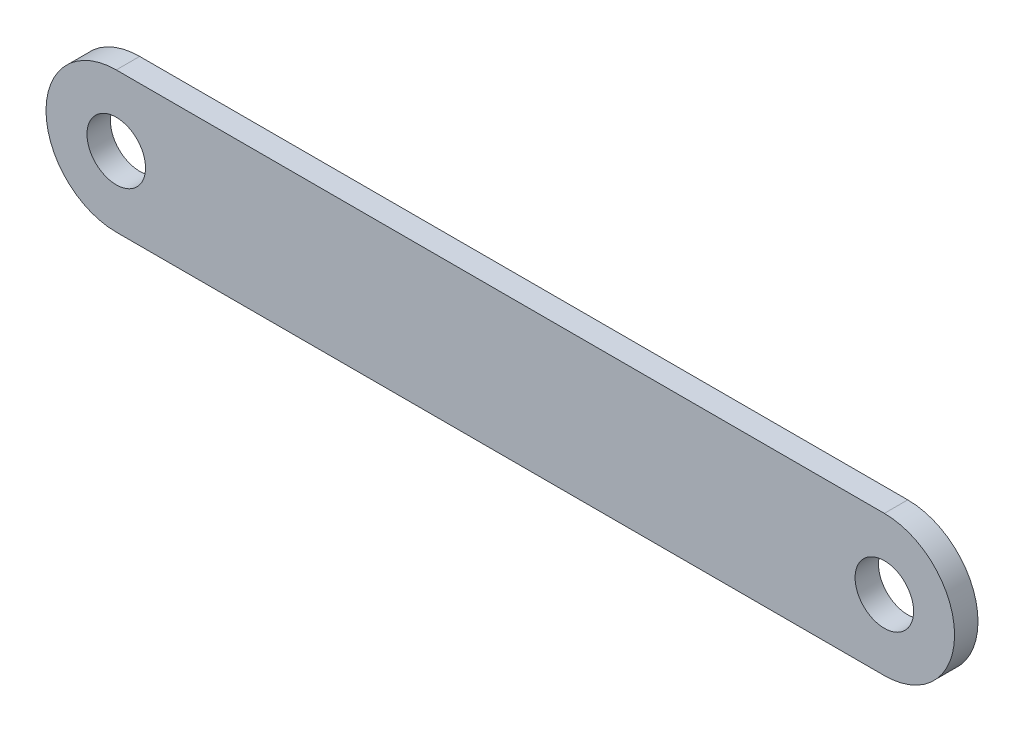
from build123d import *

# Parameters (mm, degrees)
SKETCH1_R      = 3.175
EXTRUDE1_DEPTH = 2.54


with BuildPart() as part:
    # Sketch1 → Extrude1 (new body)
    with BuildSketch(Plane.XY):
        with BuildLine():
            Line((0, 7.62), (83.312, 7.62))
            ThreePointArc((83.312, 7.62), (90.932, 0), (83.312, -7.62))
            Line((83.312, -7.62), (0, -7.62))
            ThreePointArc((0, -7.62), (-7.62, 0), (0, 7.62))
        make_face()
        Circle(SKETCH1_R, mode=Mode.SUBTRACT)
        with Locations((83.312, 0)):
            Circle(SKETCH1_R, mode=Mode.SUBTRACT)
    extrude(amount=EXTRUDE1_DEPTH)


solid = part.part
